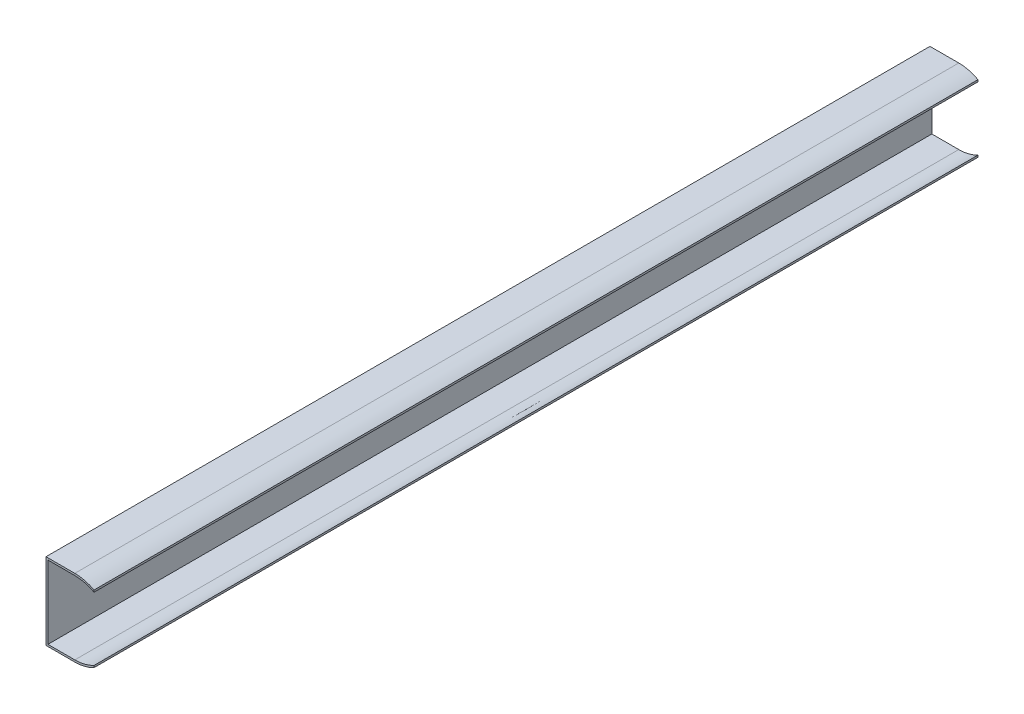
from build123d import *

# Parameters (mm, degrees)
EXTRUSION1_DEPTH = 920


with BuildPart() as part:
    # Esquisse1 → Extrusion1 (new body)
    with BuildSketch(Plane.XY):
        with BuildLine():
            Line((0, 0), (0, 80))
            Line((0, 80), (30, 80))
            add(Edge.make_bspline(
                [(30, 80), (40.603281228, 79.951543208), (50, 75)],
                knots=[0, 0, 0, 1, 1, 1], degree=2))
            Line((50, 75), (50, 73))
            add(Edge.make_bspline(
                [(30, 78), (40.603281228, 77.951543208), (50, 73)],
                knots=[0, 0, 0, 1, 1, 1], degree=2))
            Line((30, 78), (2, 78))
            Line((2, 78), (2, 2))
            Line((2, 2), (30, 2))
            add(Edge.make_bspline(
                [(30, 2), (40.603281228, 2.048456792), (50, 7)],
                knots=[0, 0, 0, 1, 1, 1], degree=2))
            Line((50, 7), (50, 5))
            add(Edge.make_bspline(
                [(30, 0), (40.603281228, 0.048456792), (50, 5)],
                knots=[0, 0, 0, 1, 1, 1], degree=2))
            Line((30, 0), (0, 0))
        make_face()
    extrude(amount=EXTRUSION1_DEPTH)


solid = part.part
